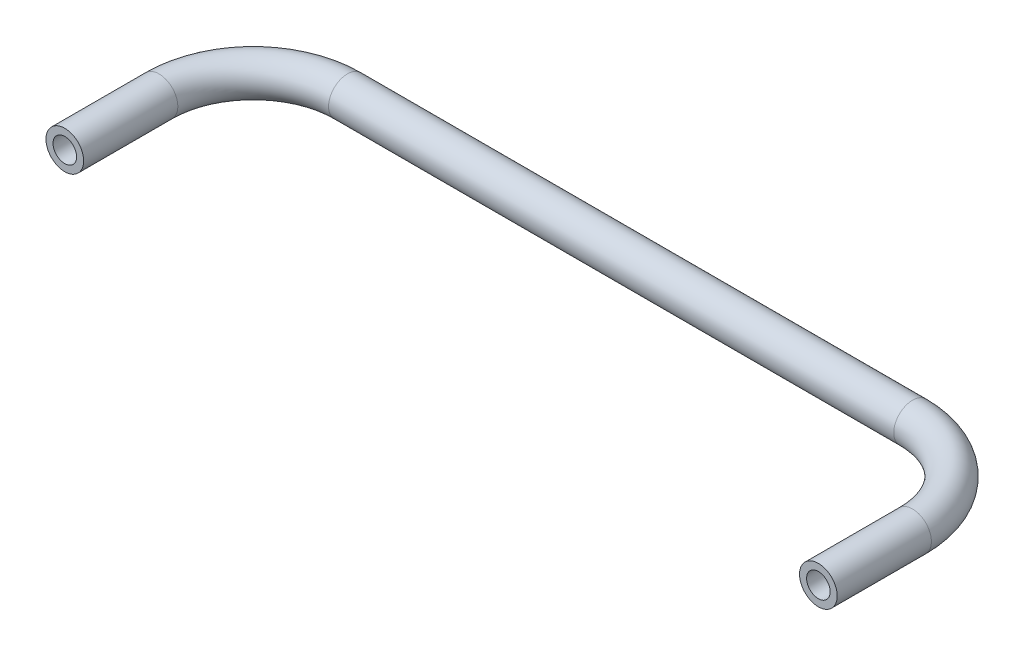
ISO-10303-21;
HEADER;
FILE_DESCRIPTION(('STEP AP214'),'2;1');
FILE_NAME('part.step','',(''),(''),'','','');
FILE_SCHEMA(('AUTOMOTIVE_DESIGN { 1 0 10303 214 1 1 1 1 }'));
ENDSEC;
DATA;
#1=APPLICATION_CONTEXT('core data for automotive mechanical design processes');
#2=APPLICATION_PROTOCOL_DEFINITION('international standard','automotive_design',2000,#1);
#3=PRODUCT_CONTEXT('',#1,'mechanical');
#4=PRODUCT('Part','Part','',(#3));
#5=PRODUCT_RELATED_PRODUCT_CATEGORY('part','',(#4));
#6=PRODUCT_DEFINITION_FORMATION('','',#4);
#7=PRODUCT_DEFINITION_CONTEXT('part definition',#1,'design');
#8=PRODUCT_DEFINITION('design','',#6,#7);
#9=PRODUCT_DEFINITION_SHAPE('','',#8);
#10=(LENGTH_UNIT() NAMED_UNIT(*) SI_UNIT(.MILLI.,.METRE.));
#11=(NAMED_UNIT(*) PLANE_ANGLE_UNIT() SI_UNIT($,.RADIAN.));
#12=(NAMED_UNIT(*) SI_UNIT($,.STERADIAN.) SOLID_ANGLE_UNIT());
#13=UNCERTAINTY_MEASURE_WITH_UNIT(LENGTH_MEASURE(1.E-05),#10,'distance_accuracy_value','');
#14=(GEOMETRIC_REPRESENTATION_CONTEXT(3) GLOBAL_UNCERTAINTY_ASSIGNED_CONTEXT((#13)) GLOBAL_UNIT_ASSIGNED_CONTEXT((#10,
#11,#12)) REPRESENTATION_CONTEXT('',''));
#15=CARTESIAN_POINT('',(0.,0.,0.));
#16=DIRECTION('',(0.,0.,1.));
#17=DIRECTION('',(1.,0.,0.));
#18=AXIS2_PLACEMENT_3D('',#15,#16,#17);
#19=CARTESIAN_POINT('',(76.2,0.,19.05));
#20=DIRECTION('',(0.,0.,1.));
#21=DIRECTION('',(1.,0.,0.));
#22=AXIS2_PLACEMENT_3D('',#19,#20,#21);
#23=CYLINDRICAL_SURFACE('',#22,3.81);
#24=CARTESIAN_POINT('',(76.2,0.,19.05));
#25=DIRECTION('',(0.,0.,-1.));
#26=DIRECTION('',(-1.,0.,0.));
#27=AXIS2_PLACEMENT_3D('',#24,#25,#26);
#28=CIRCLE('',#27,3.81);
#29=CARTESIAN_POINT('',(80.01,0.,19.05));
#30=VERTEX_POINT('',#29);
#31=EDGE_CURVE('E43',#30,#30,#28,.T.);
#32=ORIENTED_EDGE('',*,*,#31,.F.);
#33=EDGE_LOOP('',(#32));
#34=FACE_BOUND('',#33,.T.);
#35=CARTESIAN_POINT('',(76.2,0.,38.1));
#36=DIRECTION('',(0.,0.,-1.));
#37=DIRECTION('',(-1.,0.,0.));
#38=AXIS2_PLACEMENT_3D('',#35,#36,#37);
#39=CIRCLE('',#38,3.81);
#40=CARTESIAN_POINT('',(72.3900000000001,0.,38.1));
#41=VERTEX_POINT('',#40);
#42=EDGE_CURVE('E11',#41,#41,#39,.T.);
#43=ORIENTED_EDGE('',*,*,#42,.T.);
#44=EDGE_LOOP('',(#43));
#45=FACE_BOUND('',#44,.T.);
#46=ADVANCED_FACE('F36',(#34,#45),#23,.T.);
#47=CARTESIAN_POINT('',(57.15,0.,19.05));
#48=DIRECTION('',(0.,-1.,0.));
#49=DIRECTION('',(0.,0.,-1.));
#50=AXIS2_PLACEMENT_3D('',#47,#48,#49);
#51=TOROIDAL_SURFACE('',#50,19.05,3.81);
#52=CARTESIAN_POINT('',(57.15,0.,0.));
#53=DIRECTION('',(-1.,0.,0.));
#54=DIRECTION('',(0.,0.,1.));
#55=AXIS2_PLACEMENT_3D('',#52,#53,#54);
#56=CIRCLE('',#55,3.81);
#57=CARTESIAN_POINT('',(57.15,0.,-3.80999999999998));
#58=VERTEX_POINT('',#57);
#59=EDGE_CURVE('E79',#58,#58,#56,.T.);
#60=CARTESIAN_POINT('',(57.15,0.,19.05));
#61=DIRECTION('',(0.,-1.,0.));
#62=DIRECTION('',(0.,0.,-1.));
#63=AXIS2_PLACEMENT_3D('',#60,#61,#62);
#64=CIRCLE('',#63,22.86);
#65=EDGE_CURVE('',#58,#30,#64,.T.);
#66=ORIENTED_EDGE('',*,*,#59,.F.);
#67=ORIENTED_EDGE('',*,*,#31,.T.);
#68=ORIENTED_EDGE('',*,*,#65,.T.);
#69=ORIENTED_EDGE('',*,*,#65,.F.);
#70=EDGE_LOOP('',(#66,#68,#67,#69));
#71=FACE_BOUND('',#70,.T.);
#72=ADVANCED_FACE('F84',(#71),#51,.T.);
#73=CARTESIAN_POINT('',(-57.15,0.,0.));
#74=DIRECTION('',(1.,0.,0.));
#75=DIRECTION('',(0.,0.,-1.));
#76=AXIS2_PLACEMENT_3D('',#73,#74,#75);
#77=CYLINDRICAL_SURFACE('',#76,3.81);
#78=CARTESIAN_POINT('',(-57.15,0.,0.));
#79=DIRECTION('',(-1.,0.,0.));
#80=DIRECTION('',(0.,0.,1.));
#81=AXIS2_PLACEMENT_3D('',#78,#79,#80);
#82=CIRCLE('',#81,3.81);
#83=CARTESIAN_POINT('',(-57.15,0.,-3.81));
#84=VERTEX_POINT('',#83);
#85=EDGE_CURVE('E74',#84,#84,#82,.T.);
#86=CARTESIAN_POINT('',(-57.15,0.,-3.81));
#87=CARTESIAN_POINT('',(-55.959375,0.,-3.81));
#88=CARTESIAN_POINT('',(-54.76875,0.,-3.81));
#89=CARTESIAN_POINT('',(-52.3875,0.,-3.81));
#90=CARTESIAN_POINT('',(-51.196875,0.,-3.81));
#91=CARTESIAN_POINT('',(-48.815625,0.,-3.81));
#92=CARTESIAN_POINT('',(-47.625,0.,-3.81));
#93=CARTESIAN_POINT('',(-45.24375,0.,-3.81));
#94=CARTESIAN_POINT('',(-44.053125,0.,-3.81));
#95=CARTESIAN_POINT('',(-41.671875,0.,-3.81));
#96=CARTESIAN_POINT('',(-40.48125,0.,-3.81));
#97=CARTESIAN_POINT('',(-38.1,0.,-3.81));
#98=CARTESIAN_POINT('',(-36.909375,0.,-3.81));
#99=CARTESIAN_POINT('',(-34.528125,0.,-3.81));
#100=CARTESIAN_POINT('',(-33.3375,0.,-3.81));
#101=CARTESIAN_POINT('',(-30.95625,0.,-3.81));
#102=CARTESIAN_POINT('',(-29.765625,0.,-3.81));
#103=CARTESIAN_POINT('',(-27.384375,0.,-3.81));
#104=CARTESIAN_POINT('',(-26.19375,0.,-3.81));
#105=CARTESIAN_POINT('',(-23.8125,0.,-3.81));
#106=CARTESIAN_POINT('',(-22.621875,0.,-3.81));
#107=CARTESIAN_POINT('',(-20.240625,0.,-3.81));
#108=CARTESIAN_POINT('',(-19.05,0.,-3.81));
#109=CARTESIAN_POINT('',(-16.66875,0.,-3.81));
#110=CARTESIAN_POINT('',(-15.478125,0.,-3.81));
#111=CARTESIAN_POINT('',(-13.096875,0.,-3.81));
#112=CARTESIAN_POINT('',(-11.90625,0.,-3.81));
#113=CARTESIAN_POINT('',(-9.52500000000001,0.,-3.81));
#114=CARTESIAN_POINT('',(-8.334375,0.,-3.81));
#115=CARTESIAN_POINT('',(-5.953125,0.,-3.81));
#116=CARTESIAN_POINT('',(-4.7625,0.,-3.81));
#117=CARTESIAN_POINT('',(-2.38125,0.,-3.81));
#118=CARTESIAN_POINT('',(-1.190625,0.,-3.81));
#119=CARTESIAN_POINT('',(1.190625,0.,-3.81));
#120=CARTESIAN_POINT('',(2.38125,0.,-3.81));
#121=CARTESIAN_POINT('',(4.7625,0.,-3.81));
#122=CARTESIAN_POINT('',(5.953125,0.,-3.81));
#123=CARTESIAN_POINT('',(8.334375,0.,-3.81));
#124=CARTESIAN_POINT('',(9.52500000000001,0.,-3.81));
#125=CARTESIAN_POINT('',(11.90625,0.,-3.81));
#126=CARTESIAN_POINT('',(13.096875,0.,-3.81));
#127=CARTESIAN_POINT('',(15.478125,0.,-3.81));
#128=CARTESIAN_POINT('',(16.66875,0.,-3.81));
#129=CARTESIAN_POINT('',(19.05,0.,-3.81));
#130=CARTESIAN_POINT('',(20.240625,0.,-3.81));
#131=CARTESIAN_POINT('',(22.621875,0.,-3.81));
#132=CARTESIAN_POINT('',(23.8125,0.,-3.81));
#133=CARTESIAN_POINT('',(26.19375,0.,-3.81));
#134=CARTESIAN_POINT('',(27.384375,0.,-3.81));
#135=CARTESIAN_POINT('',(29.765625,0.,-3.81));
#136=CARTESIAN_POINT('',(30.95625,0.,-3.81));
#137=CARTESIAN_POINT('',(33.3375,0.,-3.81));
#138=CARTESIAN_POINT('',(34.528125,0.,-3.81));
#139=CARTESIAN_POINT('',(36.909375,0.,-3.81));
#140=CARTESIAN_POINT('',(38.1,0.,-3.81));
#141=CARTESIAN_POINT('',(40.48125,0.,-3.81));
#142=CARTESIAN_POINT('',(41.671875,0.,-3.81));
#143=CARTESIAN_POINT('',(44.053125,0.,-3.81));
#144=CARTESIAN_POINT('',(45.24375,0.,-3.81));
#145=CARTESIAN_POINT('',(47.625,0.,-3.81));
#146=CARTESIAN_POINT('',(48.815625,0.,-3.81));
#147=CARTESIAN_POINT('',(51.196875,0.,-3.81));
#148=CARTESIAN_POINT('',(52.3875,0.,-3.81));
#149=CARTESIAN_POINT('',(54.76875,0.,-3.81));
#150=CARTESIAN_POINT('',(55.959375,0.,-3.81));
#151=CARTESIAN_POINT('',(57.15,0.,-3.81));
#152=B_SPLINE_CURVE_WITH_KNOTS('',3,(#86,#87,#88,#89,#90,#91,#92,#93,#94,#95,#96,#97,#98,#99,
#100,#101,#102,#103,#104,#105,#106,#107,#108,#109,#110,#111,#112,#113,#114,#115,#116,#117,#118,
#119,#120,#121,#122,#123,#124,#125,#126,#127,#128,#129,#130,#131,#132,#133,#134,#135,#136,#137,
#138,#139,#140,#141,#142,#143,#144,#145,#146,#147,#148,#149,#150,#151),.UNSPECIFIED.,.F.,.F.,(4,
2,2,2,2,2,2,2,2,2,2,2,2,2,2,2,2,2,2,2,2,2,2,2,2,2,2,2,2,2,2,2,4),(0.,3.571875,7.14375,10.715625,
14.2875,17.859375,21.43125,25.003125,28.575,32.146875,35.71875,39.290625,42.8625,46.434375,
50.00625,53.578125,57.15,60.721875,64.29375,67.865625,71.4375,75.009375,78.58125,82.153125,
85.725,89.296875,92.86875,96.440625,100.0125,103.584375,107.15625,110.728125,114.3),.UNSPECIFIED.);
#153=EDGE_CURVE('BSEAM112',#84,#58,#152,.T.);
#154=ORIENTED_EDGE('',*,*,#85,.F.);
#155=ORIENTED_EDGE('',*,*,#59,.T.);
#156=ORIENTED_EDGE('',*,*,#153,.T.);
#157=ORIENTED_EDGE('',*,*,#153,.F.);
#158=EDGE_LOOP('',(#154,#156,#155,#157));
#159=FACE_BOUND('',#158,.T.);
#160=ADVANCED_FACE('F112',(#159),#77,.T.);
#161=CARTESIAN_POINT('',(-57.15,0.,19.05));
#162=DIRECTION('',(0.,-1.,0.));
#163=DIRECTION('',(0.,0.,-1.));
#164=AXIS2_PLACEMENT_3D('',#161,#162,#163);
#165=TOROIDAL_SURFACE('',#164,19.05,3.81);
#166=CARTESIAN_POINT('',(-76.2,0.,19.05));
#167=DIRECTION('',(0.,0.,1.));
#168=DIRECTION('',(1.,0.,0.));
#169=AXIS2_PLACEMENT_3D('',#166,#167,#168);
#170=CIRCLE('',#169,3.81);
#171=CARTESIAN_POINT('',(-80.01,0.,19.05));
#172=VERTEX_POINT('',#171);
#173=EDGE_CURVE('E71',#172,#172,#170,.T.);
#174=CARTESIAN_POINT('',(-57.15,0.,19.05));
#175=DIRECTION('',(0.,-1.,0.));
#176=DIRECTION('',(0.,0.,-1.));
#177=AXIS2_PLACEMENT_3D('',#174,#175,#176);
#178=CIRCLE('',#177,22.86);
#179=EDGE_CURVE('',#172,#84,#178,.T.);
#180=ORIENTED_EDGE('',*,*,#173,.F.);
#181=ORIENTED_EDGE('',*,*,#85,.T.);
#182=ORIENTED_EDGE('',*,*,#179,.T.);
#183=ORIENTED_EDGE('',*,*,#179,.F.);
#184=EDGE_LOOP('',(#180,#182,#181,#183));
#185=FACE_BOUND('',#184,.T.);
#186=ADVANCED_FACE('F103',(#185),#165,.T.);
#187=CARTESIAN_POINT('',(-76.2,0.,19.05));
#188=DIRECTION('',(0.,0.,1.));
#189=DIRECTION('',(1.,0.,0.));
#190=AXIS2_PLACEMENT_3D('',#187,#188,#189);
#191=CYLINDRICAL_SURFACE('',#190,3.81);
#192=ORIENTED_EDGE('',*,*,#173,.T.);
#193=EDGE_LOOP('',(#192));
#194=FACE_BOUND('',#193,.T.);
#195=CARTESIAN_POINT('',(-76.2,0.,38.1));
#196=DIRECTION('',(0.,0.,1.));
#197=DIRECTION('',(1.,0.,0.));
#198=AXIS2_PLACEMENT_3D('',#195,#196,#197);
#199=CIRCLE('',#198,3.81);
#200=CARTESIAN_POINT('',(-72.39,0.,38.1));
#201=VERTEX_POINT('',#200);
#202=EDGE_CURVE('E70',#201,#201,#199,.T.);
#203=ORIENTED_EDGE('',*,*,#202,.F.);
#204=EDGE_LOOP('',(#203));
#205=FACE_BOUND('',#204,.T.);
#206=ADVANCED_FACE('F93',(#194,#205),#191,.T.);
#207=CARTESIAN_POINT('',(76.2,0.,38.1));
#208=DIRECTION('',(0.,0.,-1.));
#209=DIRECTION('',(-1.,0.,0.));
#210=AXIS2_PLACEMENT_3D('',#207,#208,#209);
#211=PLANE('',#210);
#212=CARTESIAN_POINT('',(76.2,0.,38.1));
#213=DIRECTION('',(0.,0.,1.));
#214=DIRECTION('',(1.,0.,0.));
#215=AXIS2_PLACEMENT_3D('',#212,#213,#214);
#216=CIRCLE('',#215,2.38125);
#217=CARTESIAN_POINT('',(78.58125,0.,38.1));
#218=VERTEX_POINT('',#217);
#219=EDGE_CURVE('E59',#218,#218,#216,.T.);
#220=ORIENTED_EDGE('',*,*,#219,.F.);
#221=EDGE_LOOP('',(#220));
#222=FACE_BOUND('',#221,.T.);
#223=ORIENTED_EDGE('',*,*,#42,.F.);
#224=EDGE_LOOP('',(#223));
#225=FACE_BOUND('',#224,.T.);
#226=ADVANCED_FACE('F90',(#222,#225),#211,.F.);
#227=CARTESIAN_POINT('',(-76.2,0.,38.1));
#228=DIRECTION('',(0.,0.,1.));
#229=DIRECTION('',(1.,0.,0.));
#230=AXIS2_PLACEMENT_3D('',#227,#228,#229);
#231=PLANE('',#230);
#232=CARTESIAN_POINT('',(-76.2,0.,38.1));
#233=DIRECTION('',(0.,0.,1.));
#234=DIRECTION('',(1.,0.,0.));
#235=AXIS2_PLACEMENT_3D('',#232,#233,#234);
#236=CIRCLE('',#235,2.38125);
#237=CARTESIAN_POINT('',(-73.81875,0.,38.1));
#238=VERTEX_POINT('',#237);
#239=EDGE_CURVE('E60',#238,#238,#236,.T.);
#240=ORIENTED_EDGE('',*,*,#239,.F.);
#241=EDGE_LOOP('',(#240));
#242=FACE_BOUND('',#241,.T.);
#243=ORIENTED_EDGE('',*,*,#202,.T.);
#244=EDGE_LOOP('',(#243));
#245=FACE_BOUND('',#244,.T.);
#246=ADVANCED_FACE('F92',(#242,#245),#231,.T.);
#247=CARTESIAN_POINT('',(76.2,0.,19.05));
#248=DIRECTION('',(0.,0.,1.));
#249=DIRECTION('',(1.,0.,0.));
#250=AXIS2_PLACEMENT_3D('',#247,#248,#249);
#251=CONICAL_SURFACE('',#250,2.38125,1.02974425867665);
#252=CARTESIAN_POINT('',(76.2,0.,17.6192006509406));
#253=VERTEX_POINT('',#252);
#254=VERTEX_LOOP('',#253);
#255=FACE_BOUND('',#254,.T.);
#256=CARTESIAN_POINT('',(76.2,0.,19.05));
#257=DIRECTION('',(0.,0.,1.));
#258=DIRECTION('',(1.,0.,0.));
#259=AXIS2_PLACEMENT_3D('',#256,#257,#258);
#260=CIRCLE('',#259,2.38125);
#261=CARTESIAN_POINT('',(78.58125,0.,19.05));
#262=VERTEX_POINT('',#261);
#263=EDGE_CURVE('E63',#262,#262,#260,.T.);
#264=ORIENTED_EDGE('',*,*,#263,.T.);
#265=EDGE_LOOP('',(#264));
#266=FACE_BOUND('',#265,.T.);
#267=ADVANCED_FACE('F100',(#255,#266),#251,.F.);
#268=CARTESIAN_POINT('',(76.2,0.,38.1));
#269=DIRECTION('',(0.,0.,1.));
#270=DIRECTION('',(1.,0.,0.));
#271=AXIS2_PLACEMENT_3D('',#268,#269,#270);
#272=CYLINDRICAL_SURFACE('',#271,2.38125);
#273=ORIENTED_EDGE('',*,*,#263,.F.);
#274=EDGE_LOOP('',(#273));
#275=FACE_BOUND('',#274,.T.);
#276=ORIENTED_EDGE('',*,*,#219,.T.);
#277=EDGE_LOOP('',(#276));
#278=FACE_BOUND('',#277,.T.);
#279=ADVANCED_FACE('F53',(#275,#278),#272,.F.);
#280=CARTESIAN_POINT('',(-76.2,0.,19.05));
#281=DIRECTION('',(0.,0.,1.));
#282=DIRECTION('',(1.,0.,0.));
#283=AXIS2_PLACEMENT_3D('',#280,#281,#282);
#284=CONICAL_SURFACE('',#283,2.38124999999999,1.02974425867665);
#285=CARTESIAN_POINT('',(-76.2,0.,17.6192006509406));
#286=VERTEX_POINT('',#285);
#287=VERTEX_LOOP('',#286);
#288=FACE_BOUND('',#287,.T.);
#289=CARTESIAN_POINT('',(-76.2,0.,19.05));
#290=DIRECTION('',(0.,0.,1.));
#291=DIRECTION('',(1.,0.,0.));
#292=AXIS2_PLACEMENT_3D('',#289,#290,#291);
#293=CIRCLE('',#292,2.38124999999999);
#294=CARTESIAN_POINT('',(-73.81875,0.,19.05));
#295=VERTEX_POINT('',#294);
#296=EDGE_CURVE('E57',#295,#295,#293,.T.);
#297=ORIENTED_EDGE('',*,*,#296,.T.);
#298=EDGE_LOOP('',(#297));
#299=FACE_BOUND('',#298,.T.);
#300=ADVANCED_FACE('F49',(#288,#299),#284,.F.);
#301=CARTESIAN_POINT('',(-76.2,0.,38.1));
#302=DIRECTION('',(0.,0.,1.));
#303=DIRECTION('',(1.,0.,0.));
#304=AXIS2_PLACEMENT_3D('',#301,#302,#303);
#305=CYLINDRICAL_SURFACE('',#304,2.38124999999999);
#306=ORIENTED_EDGE('',*,*,#296,.F.);
#307=EDGE_LOOP('',(#306));
#308=FACE_BOUND('',#307,.T.);
#309=ORIENTED_EDGE('',*,*,#239,.T.);
#310=EDGE_LOOP('',(#309));
#311=FACE_BOUND('',#310,.T.);
#312=ADVANCED_FACE('F52',(#308,#311),#305,.F.);
#313=CLOSED_SHELL('',(#46,#72,#160,#186,#206,#226,#246,#267,#279,#300,#312));
#314=MANIFOLD_SOLID_BREP('B2',#313);
#315=ADVANCED_BREP_SHAPE_REPRESENTATION('',(#18,#314),#14);
#316=SHAPE_DEFINITION_REPRESENTATION(#9,#315);
ENDSEC;
END-ISO-10303-21;
